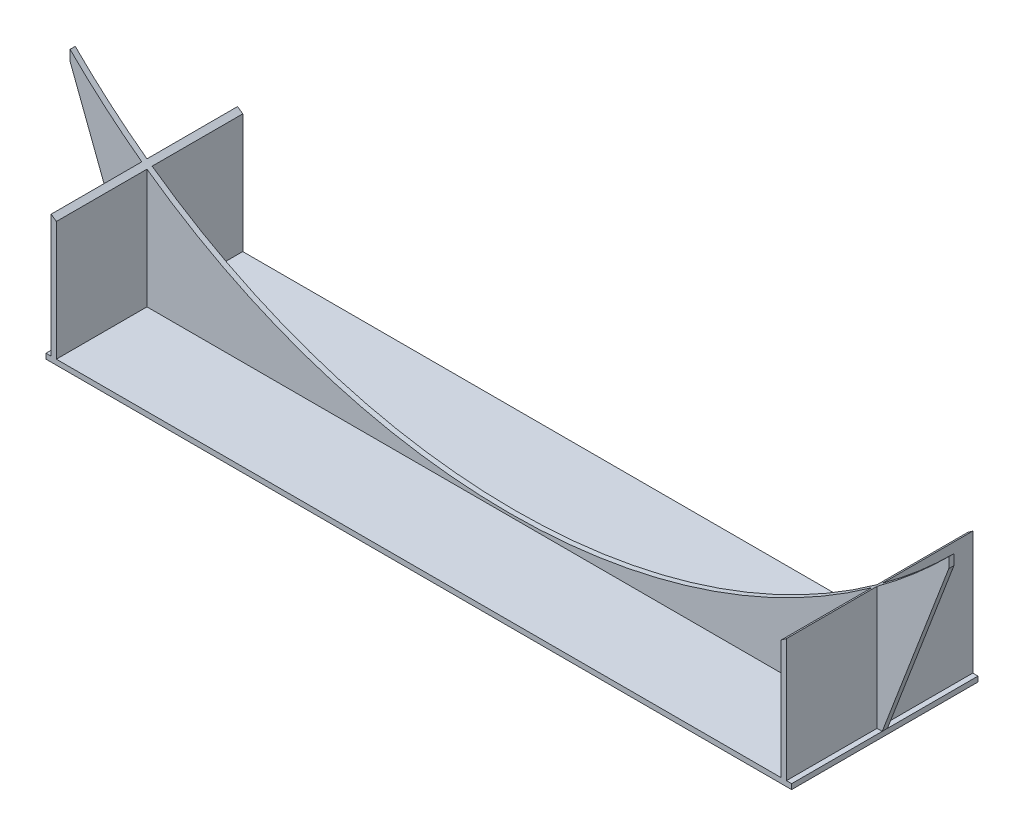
ISO-10303-21;
HEADER;
FILE_DESCRIPTION(('STEP AP214'),'2;1');
FILE_NAME('part.step','',(''),(''),'','','');
FILE_SCHEMA(('AUTOMOTIVE_DESIGN { 1 0 10303 214 1 1 1 1 }'));
ENDSEC;
DATA;
#1=APPLICATION_CONTEXT('core data for automotive mechanical design processes');
#2=APPLICATION_PROTOCOL_DEFINITION('international standard','automotive_design',2000,#1);
#3=PRODUCT_CONTEXT('',#1,'mechanical');
#4=PRODUCT('Part','Part','',(#3));
#5=PRODUCT_RELATED_PRODUCT_CATEGORY('part','',(#4));
#6=PRODUCT_DEFINITION_FORMATION('','',#4);
#7=PRODUCT_DEFINITION_CONTEXT('part definition',#1,'design');
#8=PRODUCT_DEFINITION('design','',#6,#7);
#9=PRODUCT_DEFINITION_SHAPE('','',#8);
#10=(LENGTH_UNIT() NAMED_UNIT(*) SI_UNIT(.MILLI.,.METRE.));
#11=(NAMED_UNIT(*) PLANE_ANGLE_UNIT() SI_UNIT($,.RADIAN.));
#12=(NAMED_UNIT(*) SI_UNIT($,.STERADIAN.) SOLID_ANGLE_UNIT());
#13=UNCERTAINTY_MEASURE_WITH_UNIT(LENGTH_MEASURE(1.E-05),#10,'distance_accuracy_value','');
#14=(GEOMETRIC_REPRESENTATION_CONTEXT(3) GLOBAL_UNCERTAINTY_ASSIGNED_CONTEXT((#13)) GLOBAL_UNIT_ASSIGNED_CONTEXT((#10,
#11,#12)) REPRESENTATION_CONTEXT('',''));
#15=CARTESIAN_POINT('',(0.,0.,0.));
#16=DIRECTION('',(0.,0.,1.));
#17=DIRECTION('',(1.,0.,0.));
#18=AXIS2_PLACEMENT_3D('',#15,#16,#17);
#19=CARTESIAN_POINT('',(0.,1543.05,6.35));
#20=DIRECTION('',(0.,0.,-1.));
#21=DIRECTION('',(-1.,0.,0.));
#22=AXIS2_PLACEMENT_3D('',#19,#20,#21);
#23=PLANE('',#22);
#24=DIRECTION('',(-1.,0.,0.));
#25=VECTOR('',#24,1.);
#26=CARTESIAN_POINT('',(0.,12.6999999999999,6.35));
#27=LINE('',#26,#25);
#28=CARTESIAN_POINT('',(914.4,12.7,6.35));
#29=VERTEX_POINT('',#28);
#30=CARTESIAN_POINT('',(901.7,12.6999999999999,6.35));
#31=VERTEX_POINT('',#30);
#32=EDGE_CURVE('E336',#29,#31,#27,.T.);
#33=ORIENTED_EDGE('',*,*,#32,.F.);
#34=DIRECTION('',(0.356839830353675,0.934165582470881,0.));
#35=VECTOR('',#34,1.);
#36=CARTESIAN_POINT('',(914.4,12.7,6.35));
#37=LINE('',#36,#35);
#38=CARTESIAN_POINT('',(1077.6307345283,440.019265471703,6.35));
#39=VERTEX_POINT('',#38);
#40=EDGE_CURVE('E339',#29,#39,#37,.T.);
#41=ORIENTED_EDGE('',*,*,#40,.T.);
#42=DIRECTION('',(0.,1.,0.));
#43=VECTOR('',#42,1.);
#44=CARTESIAN_POINT('',(1077.6307345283,440.019265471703,6.35));
#45=LINE('',#44,#43);
#46=CARTESIAN_POINT('',(1077.6307345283,465.419265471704,6.35));
#47=VERTEX_POINT('',#46);
#48=EDGE_CURVE('E341',#39,#47,#45,.T.);
#49=ORIENTED_EDGE('',*,*,#48,.T.);
#50=CARTESIAN_POINT('',(0.,1543.05,6.35));
#51=DIRECTION('',(0.,0.,-1.));
#52=DIRECTION('',(-1.,0.,0.));
#53=AXIS2_PLACEMENT_3D('',#50,#51,#52);
#54=CIRCLE('',#53,1524.);
#55=CARTESIAN_POINT('',(901.7,314.427555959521,6.35));
#56=VERTEX_POINT('',#55);
#57=EDGE_CURVE('E345',#47,#56,#54,.T.);
#58=ORIENTED_EDGE('',*,*,#57,.T.);
#59=DIRECTION('',(0.,1.,0.));
#60=VECTOR('',#59,1.);
#61=CARTESIAN_POINT('',(901.700000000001,1543.05,6.35));
#62=LINE('',#61,#60);
#63=EDGE_CURVE('E47',#31,#56,#62,.T.);
#64=ORIENTED_EDGE('',*,*,#63,.F.);
#65=EDGE_LOOP('',(#33,#41,#49,#58,#64));
#66=FACE_BOUND('',#65,.T.);
#67=ADVANCED_FACE('F32',(#66),#23,.F.);
#68=DIRECTION('',(0.,-1.,0.));
#69=VECTOR('',#68,1.);
#70=CARTESIAN_POINT('',(888.999999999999,1543.05,6.35));
#71=LINE('',#70,#69);
#72=CARTESIAN_POINT('',(889.,305.207118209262,6.35));
#73=VERTEX_POINT('',#72);
#74=CARTESIAN_POINT('',(889.,12.6999999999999,6.35));
#75=VERTEX_POINT('',#74);
#76=EDGE_CURVE('E333',#73,#75,#71,.T.);
#77=ORIENTED_EDGE('',*,*,#76,.F.);
#78=CARTESIAN_POINT('',(-889.,305.207118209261,6.35));
#79=VERTEX_POINT('',#78);
#80=EDGE_CURVE('E348',#73,#79,#54,.T.);
#81=ORIENTED_EDGE('',*,*,#80,.T.);
#82=DIRECTION('',(0.,1.,0.));
#83=VECTOR('',#82,1.);
#84=CARTESIAN_POINT('',(-889.,1543.05,6.35));
#85=LINE('',#84,#83);
#86=CARTESIAN_POINT('',(-889.,12.6999999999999,6.35));
#87=VERTEX_POINT('',#86);
#88=EDGE_CURVE('E329',#87,#79,#85,.T.);
#89=ORIENTED_EDGE('',*,*,#88,.F.);
#90=DIRECTION('',(-1.,0.,0.));
#91=VECTOR('',#90,1.);
#92=CARTESIAN_POINT('',(0.,12.6999999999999,6.35));
#93=LINE('',#92,#91);
#94=EDGE_CURVE('E55',#75,#87,#93,.T.);
#95=ORIENTED_EDGE('',*,*,#94,.F.);
#96=EDGE_LOOP('',(#77,#81,#89,#95));
#97=FACE_BOUND('',#96,.T.);
#98=ADVANCED_FACE('F462',(#97),#23,.F.);
#99=DIRECTION('',(0.,-1.,0.));
#100=VECTOR('',#99,1.);
#101=CARTESIAN_POINT('',(-901.700000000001,1543.05,6.35));
#102=LINE('',#101,#100);
#103=CARTESIAN_POINT('',(-901.7,314.427555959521,6.35));
#104=VERTEX_POINT('',#103);
#105=CARTESIAN_POINT('',(-901.7,12.6999999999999,6.35));
#106=VERTEX_POINT('',#105);
#107=EDGE_CURVE('E326',#104,#106,#102,.T.);
#108=ORIENTED_EDGE('',*,*,#107,.F.);
#109=CARTESIAN_POINT('',(-1077.6307345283,465.419265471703,6.35));
#110=VERTEX_POINT('',#109);
#111=EDGE_CURVE('E344',#104,#110,#54,.T.);
#112=ORIENTED_EDGE('',*,*,#111,.T.);
#113=DIRECTION('',(0.,-1.,0.));
#114=VECTOR('',#113,1.);
#115=CARTESIAN_POINT('',(-1077.6307345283,465.419265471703,6.35));
#116=LINE('',#115,#114);
#117=CARTESIAN_POINT('',(-1077.6307345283,440.019265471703,6.35));
#118=VERTEX_POINT('',#117);
#119=EDGE_CURVE('E347',#110,#118,#116,.T.);
#120=ORIENTED_EDGE('',*,*,#119,.T.);
#121=DIRECTION('',(0.356839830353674,-0.934165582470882,0.));
#122=VECTOR('',#121,1.);
#123=CARTESIAN_POINT('',(-914.4,12.7,6.35));
#124=LINE('',#123,#122);
#125=CARTESIAN_POINT('',(-914.4,12.7,6.35));
#126=VERTEX_POINT('',#125);
#127=EDGE_CURVE('E350',#118,#126,#124,.T.);
#128=ORIENTED_EDGE('',*,*,#127,.T.);
#129=DIRECTION('',(-1.,0.,0.));
#130=VECTOR('',#129,1.);
#131=CARTESIAN_POINT('',(0.,12.6999999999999,6.35));
#132=LINE('',#131,#130);
#133=EDGE_CURVE('E323',#106,#126,#132,.T.);
#134=ORIENTED_EDGE('',*,*,#133,.F.);
#135=EDGE_LOOP('',(#108,#112,#120,#128,#134));
#136=FACE_BOUND('',#135,.T.);
#137=ADVANCED_FACE('F455',(#136),#23,.F.);
#138=CARTESIAN_POINT('',(0.,1543.05,-6.35));
#139=DIRECTION('',(0.,0.,-1.));
#140=DIRECTION('',(-1.,0.,0.));
#141=AXIS2_PLACEMENT_3D('',#138,#139,#140);
#142=PLANE('',#141);
#143=DIRECTION('',(0.356839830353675,0.934165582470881,0.));
#144=VECTOR('',#143,1.);
#145=CARTESIAN_POINT('',(914.4,12.7,-6.35));
#146=LINE('',#145,#144);
#147=CARTESIAN_POINT('',(914.4,12.7,-6.34999999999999));
#148=VERTEX_POINT('',#147);
#149=CARTESIAN_POINT('',(1077.6307345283,440.019265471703,-6.35));
#150=VERTEX_POINT('',#149);
#151=EDGE_CURVE('E338',#148,#150,#146,.T.);
#152=ORIENTED_EDGE('',*,*,#151,.F.);
#153=DIRECTION('',(-1.,0.,0.));
#154=VECTOR('',#153,1.);
#155=CARTESIAN_POINT('',(0.,12.6999999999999,-6.35));
#156=LINE('',#155,#154);
#157=CARTESIAN_POINT('',(901.7,12.7,-6.34999999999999));
#158=VERTEX_POINT('',#157);
#159=EDGE_CURVE('E11',#148,#158,#156,.T.);
#160=ORIENTED_EDGE('',*,*,#159,.T.);
#161=DIRECTION('',(0.,1.,0.));
#162=VECTOR('',#161,1.);
#163=CARTESIAN_POINT('',(901.700000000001,1543.05,-6.35));
#164=LINE('',#163,#162);
#165=CARTESIAN_POINT('',(901.7,314.427555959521,-6.34999999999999));
#166=VERTEX_POINT('',#165);
#167=EDGE_CURVE('E40',#158,#166,#164,.T.);
#168=ORIENTED_EDGE('',*,*,#167,.T.);
#169=CARTESIAN_POINT('',(0.,1543.05,-6.35));
#170=DIRECTION('',(0.,0.,-1.));
#171=DIRECTION('',(-1.,0.,0.));
#172=AXIS2_PLACEMENT_3D('',#169,#170,#171);
#173=CIRCLE('',#172,1524.);
#174=CARTESIAN_POINT('',(1077.6307345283,465.419265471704,-6.35));
#175=VERTEX_POINT('',#174);
#176=EDGE_CURVE('E357',#175,#166,#173,.T.);
#177=ORIENTED_EDGE('',*,*,#176,.F.);
#178=DIRECTION('',(0.,1.,0.));
#179=VECTOR('',#178,1.);
#180=CARTESIAN_POINT('',(1077.6307345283,440.019265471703,-6.35));
#181=LINE('',#180,#179);
#182=EDGE_CURVE('E354',#150,#175,#181,.T.);
#183=ORIENTED_EDGE('',*,*,#182,.F.);
#184=EDGE_LOOP('',(#152,#160,#168,#177,#183));
#185=FACE_BOUND('',#184,.T.);
#186=ADVANCED_FACE('F400',(#185),#142,.T.);
#187=CARTESIAN_POINT('',(889.,305.207118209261,-6.34999999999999));
#188=VERTEX_POINT('',#187);
#189=CARTESIAN_POINT('',(-889.,305.207118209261,-6.34999999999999));
#190=VERTEX_POINT('',#189);
#191=EDGE_CURVE('E361',#188,#190,#173,.T.);
#192=ORIENTED_EDGE('',*,*,#191,.F.);
#193=DIRECTION('',(0.,-1.,0.));
#194=VECTOR('',#193,1.);
#195=CARTESIAN_POINT('',(888.999999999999,1543.05,-6.35));
#196=LINE('',#195,#194);
#197=CARTESIAN_POINT('',(889.,12.7,-6.34999999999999));
#198=VERTEX_POINT('',#197);
#199=EDGE_CURVE('E394',#188,#198,#196,.T.);
#200=ORIENTED_EDGE('',*,*,#199,.T.);
#201=DIRECTION('',(-1.,0.,0.));
#202=VECTOR('',#201,1.);
#203=CARTESIAN_POINT('',(0.,12.6999999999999,-6.35));
#204=LINE('',#203,#202);
#205=CARTESIAN_POINT('',(-889.,12.7,-6.34999999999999));
#206=VERTEX_POINT('',#205);
#207=EDGE_CURVE('E391',#198,#206,#204,.T.);
#208=ORIENTED_EDGE('',*,*,#207,.T.);
#209=DIRECTION('',(0.,1.,0.));
#210=VECTOR('',#209,1.);
#211=CARTESIAN_POINT('',(-889.,1543.05,-6.35));
#212=LINE('',#211,#210);
#213=EDGE_CURVE('E388',#206,#190,#212,.T.);
#214=ORIENTED_EDGE('',*,*,#213,.T.);
#215=EDGE_LOOP('',(#192,#200,#208,#214));
#216=FACE_BOUND('',#215,.T.);
#217=ADVANCED_FACE('F432',(#216),#142,.T.);
#218=CARTESIAN_POINT('',(-901.7,314.427555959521,-6.34999999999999));
#219=VERTEX_POINT('',#218);
#220=CARTESIAN_POINT('',(-1077.6307345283,465.419265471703,-6.35));
#221=VERTEX_POINT('',#220);
#222=EDGE_CURVE('E356',#219,#221,#173,.T.);
#223=ORIENTED_EDGE('',*,*,#222,.F.);
#224=DIRECTION('',(0.,-1.,0.));
#225=VECTOR('',#224,1.);
#226=CARTESIAN_POINT('',(-901.700000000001,1543.05,-6.35));
#227=LINE('',#226,#225);
#228=CARTESIAN_POINT('',(-901.7,12.7,-6.34999999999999));
#229=VERTEX_POINT('',#228);
#230=EDGE_CURVE('E385',#219,#229,#227,.T.);
#231=ORIENTED_EDGE('',*,*,#230,.T.);
#232=DIRECTION('',(-1.,0.,0.));
#233=VECTOR('',#232,1.);
#234=CARTESIAN_POINT('',(0.,12.6999999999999,-6.35));
#235=LINE('',#234,#233);
#236=CARTESIAN_POINT('',(-914.4,12.7,-6.34999999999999));
#237=VERTEX_POINT('',#236);
#238=EDGE_CURVE('E382',#229,#237,#235,.T.);
#239=ORIENTED_EDGE('',*,*,#238,.T.);
#240=DIRECTION('',(0.356839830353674,-0.934165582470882,0.));
#241=VECTOR('',#240,1.);
#242=CARTESIAN_POINT('',(-914.4,12.7,-6.35));
#243=LINE('',#242,#241);
#244=CARTESIAN_POINT('',(-1077.6307345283,440.019265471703,-6.35));
#245=VERTEX_POINT('',#244);
#246=EDGE_CURVE('E342',#245,#237,#243,.T.);
#247=ORIENTED_EDGE('',*,*,#246,.F.);
#248=DIRECTION('',(0.,-1.,0.));
#249=VECTOR('',#248,1.);
#250=CARTESIAN_POINT('',(-1077.6307345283,465.419265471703,-6.35));
#251=LINE('',#250,#249);
#252=EDGE_CURVE('E360',#221,#245,#251,.T.);
#253=ORIENTED_EDGE('',*,*,#252,.F.);
#254=EDGE_LOOP('',(#223,#231,#239,#247,#253));
#255=FACE_BOUND('',#254,.T.);
#256=ADVANCED_FACE('F443',(#255),#142,.T.);
#257=CARTESIAN_POINT('',(-914.4,0.,6.35));
#258=DIRECTION('',(1.,0.,0.));
#259=DIRECTION('',(0.,1.,0.));
#260=AXIS2_PLACEMENT_3D('',#257,#258,#259);
#261=PLANE('',#260);
#262=DIRECTION('',(0.,0.,-1.));
#263=VECTOR('',#262,1.);
#264=CARTESIAN_POINT('',(-914.4,12.7,6.35));
#265=LINE('',#264,#263);
#266=EDGE_CURVE('E352',#126,#237,#265,.T.);
#267=ORIENTED_EDGE('',*,*,#266,.T.);
#268=DIRECTION('',(0.,0.,-1.));
#269=VECTOR('',#268,1.);
#270=CARTESIAN_POINT('',(-914.4,12.7,228.6));
#271=LINE('',#270,#269);
#272=CARTESIAN_POINT('',(-914.4,12.7,-228.6));
#273=VERTEX_POINT('',#272);
#274=EDGE_CURVE('E256',#237,#273,#271,.T.);
#275=ORIENTED_EDGE('',*,*,#274,.T.);
#276=DIRECTION('',(0.,-1.,0.));
#277=VECTOR('',#276,1.);
#278=CARTESIAN_POINT('',(-914.4,0.,-228.6));
#279=LINE('',#278,#277);
#280=CARTESIAN_POINT('',(-914.4,0.,-228.6));
#281=VERTEX_POINT('',#280);
#282=EDGE_CURVE('E232',#273,#281,#279,.T.);
#283=ORIENTED_EDGE('',*,*,#282,.T.);
#284=DIRECTION('',(0.,0.,-1.));
#285=VECTOR('',#284,1.);
#286=CARTESIAN_POINT('',(-914.4,0.,6.35));
#287=LINE('',#286,#285);
#288=CARTESIAN_POINT('',(-914.4,0.,228.6));
#289=VERTEX_POINT('',#288);
#290=EDGE_CURVE('E215',#289,#281,#287,.T.);
#291=ORIENTED_EDGE('',*,*,#290,.F.);
#292=DIRECTION('',(0.,-1.,0.));
#293=VECTOR('',#292,1.);
#294=CARTESIAN_POINT('',(-914.4,0.,228.6));
#295=LINE('',#294,#293);
#296=CARTESIAN_POINT('',(-914.4,12.7,228.6));
#297=VERTEX_POINT('',#296);
#298=EDGE_CURVE('E231',#297,#289,#295,.T.);
#299=ORIENTED_EDGE('',*,*,#298,.F.);
#300=EDGE_CURVE('E286',#297,#126,#271,.T.);
#301=ORIENTED_EDGE('',*,*,#300,.T.);
#302=EDGE_LOOP('',(#267,#275,#283,#291,#299,#301));
#303=FACE_BOUND('',#302,.T.);
#304=ADVANCED_FACE('F34',(#303),#261,.F.);
#305=CARTESIAN_POINT('',(-914.4,0.,6.35));
#306=DIRECTION('',(0.,1.,0.));
#307=DIRECTION('',(0.,0.,1.));
#308=AXIS2_PLACEMENT_3D('',#305,#306,#307);
#309=PLANE('',#308);
#310=ORIENTED_EDGE('',*,*,#290,.T.);
#311=DIRECTION('',(1.,0.,0.));
#312=VECTOR('',#311,1.);
#313=CARTESIAN_POINT('',(914.4,0.,-228.6));
#314=LINE('',#313,#312);
#315=CARTESIAN_POINT('',(914.4,0.,-228.6));
#316=VERTEX_POINT('',#315);
#317=EDGE_CURVE('E211',#281,#316,#314,.T.);
#318=ORIENTED_EDGE('',*,*,#317,.T.);
#319=DIRECTION('',(0.,0.,-1.));
#320=VECTOR('',#319,1.);
#321=CARTESIAN_POINT('',(914.4,0.,6.35));
#322=LINE('',#321,#320);
#323=CARTESIAN_POINT('',(914.4,0.,228.6));
#324=VERTEX_POINT('',#323);
#325=EDGE_CURVE('E205',#324,#316,#322,.T.);
#326=ORIENTED_EDGE('',*,*,#325,.F.);
#327=DIRECTION('',(1.,0.,0.));
#328=VECTOR('',#327,1.);
#329=CARTESIAN_POINT('',(914.4,0.,228.6));
#330=LINE('',#329,#328);
#331=EDGE_CURVE('E209',#289,#324,#330,.T.);
#332=ORIENTED_EDGE('',*,*,#331,.F.);
#333=EDGE_LOOP('',(#310,#318,#326,#332));
#334=FACE_BOUND('',#333,.T.);
#335=ADVANCED_FACE('F207',(#334),#309,.F.);
#336=CARTESIAN_POINT('',(914.4,0.,6.35));
#337=DIRECTION('',(-1.,0.,0.));
#338=DIRECTION('',(0.,-1.,0.));
#339=AXIS2_PLACEMENT_3D('',#336,#337,#338);
#340=PLANE('',#339);
#341=ORIENTED_EDGE('',*,*,#325,.T.);
#342=DIRECTION('',(0.,1.,0.));
#343=VECTOR('',#342,1.);
#344=CARTESIAN_POINT('',(914.4,12.7,-228.6));
#345=LINE('',#344,#343);
#346=CARTESIAN_POINT('',(914.4,12.7,-228.6));
#347=VERTEX_POINT('',#346);
#348=EDGE_CURVE('E258',#316,#347,#345,.T.);
#349=ORIENTED_EDGE('',*,*,#348,.T.);
#350=DIRECTION('',(0.,0.,-1.));
#351=VECTOR('',#350,1.);
#352=CARTESIAN_POINT('',(914.4,12.7,228.6));
#353=LINE('',#352,#351);
#354=EDGE_CURVE('E321',#148,#347,#353,.T.);
#355=ORIENTED_EDGE('',*,*,#354,.F.);
#356=DIRECTION('',(0.,0.,-1.));
#357=VECTOR('',#356,1.);
#358=CARTESIAN_POINT('',(914.4,12.7,6.35));
#359=LINE('',#358,#357);
#360=EDGE_CURVE('E216',#29,#148,#359,.T.);
#361=ORIENTED_EDGE('',*,*,#360,.F.);
#362=CARTESIAN_POINT('',(914.4,12.7,228.6));
#363=VERTEX_POINT('',#362);
#364=EDGE_CURVE('E223',#363,#29,#353,.T.);
#365=ORIENTED_EDGE('',*,*,#364,.F.);
#366=DIRECTION('',(0.,1.,0.));
#367=VECTOR('',#366,1.);
#368=CARTESIAN_POINT('',(914.4,12.7,228.6));
#369=LINE('',#368,#367);
#370=EDGE_CURVE('E219',#324,#363,#369,.T.);
#371=ORIENTED_EDGE('',*,*,#370,.F.);
#372=EDGE_LOOP('',(#341,#349,#355,#361,#365,#371));
#373=FACE_BOUND('',#372,.T.);
#374=ADVANCED_FACE('F220',(#373),#340,.F.);
#375=CARTESIAN_POINT('',(914.4,12.7,6.35));
#376=DIRECTION('',(-0.934165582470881,0.356839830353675,0.));
#377=DIRECTION('',(-0.356839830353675,-0.934165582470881,0.));
#378=AXIS2_PLACEMENT_3D('',#375,#376,#377);
#379=PLANE('',#378);
#380=ORIENTED_EDGE('',*,*,#151,.T.);
#381=DIRECTION('',(0.,0.,-1.));
#382=VECTOR('',#381,1.);
#383=CARTESIAN_POINT('',(1077.6307345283,440.019265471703,6.35));
#384=LINE('',#383,#382);
#385=EDGE_CURVE('E376',#39,#150,#384,.T.);
#386=ORIENTED_EDGE('',*,*,#385,.F.);
#387=ORIENTED_EDGE('',*,*,#40,.F.);
#388=ORIENTED_EDGE('',*,*,#360,.T.);
#389=EDGE_LOOP('',(#380,#386,#387,#388));
#390=FACE_BOUND('',#389,.T.);
#391=ADVANCED_FACE('F414',(#390),#379,.F.);
#392=CARTESIAN_POINT('',(1077.6307345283,440.019265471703,6.35));
#393=DIRECTION('',(-1.,0.,0.));
#394=DIRECTION('',(0.,-1.,0.));
#395=AXIS2_PLACEMENT_3D('',#392,#393,#394);
#396=PLANE('',#395);
#397=ORIENTED_EDGE('',*,*,#182,.T.);
#398=DIRECTION('',(0.,0.,-1.));
#399=VECTOR('',#398,1.);
#400=CARTESIAN_POINT('',(1077.6307345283,465.419265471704,6.35));
#401=LINE('',#400,#399);
#402=EDGE_CURVE('E373',#47,#175,#401,.T.);
#403=ORIENTED_EDGE('',*,*,#402,.F.);
#404=ORIENTED_EDGE('',*,*,#48,.F.);
#405=ORIENTED_EDGE('',*,*,#385,.T.);
#406=EDGE_LOOP('',(#397,#403,#404,#405));
#407=FACE_BOUND('',#406,.T.);
#408=ADVANCED_FACE('F411',(#407),#396,.F.);
#409=CARTESIAN_POINT('',(0.,1543.05,6.35));
#410=DIRECTION('',(0.,0.,-1.));
#411=DIRECTION('',(-1.,0.,0.));
#412=AXIS2_PLACEMENT_3D('',#409,#410,#411);
#413=CYLINDRICAL_SURFACE('',#412,1524.);
#414=DIRECTION('',(0.,0.,-1.));
#415=VECTOR('',#414,1.);
#416=CARTESIAN_POINT('',(-901.7,314.427555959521,228.6));
#417=LINE('',#416,#415);
#418=CARTESIAN_POINT('',(-901.7,314.427555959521,-228.6));
#419=VERTEX_POINT('',#418);
#420=EDGE_CURVE('E293',#219,#419,#417,.T.);
#421=ORIENTED_EDGE('',*,*,#420,.F.);
#422=ORIENTED_EDGE('',*,*,#222,.T.);
#423=DIRECTION('',(0.,0.,-1.));
#424=VECTOR('',#423,1.);
#425=CARTESIAN_POINT('',(-1077.6307345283,465.419265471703,6.35));
#426=LINE('',#425,#424);
#427=EDGE_CURVE('E370',#110,#221,#426,.T.);
#428=ORIENTED_EDGE('',*,*,#427,.F.);
#429=ORIENTED_EDGE('',*,*,#111,.F.);
#430=CARTESIAN_POINT('',(-901.7,314.427555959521,228.6));
#431=VERTEX_POINT('',#430);
#432=EDGE_CURVE('E294',#431,#104,#417,.T.);
#433=ORIENTED_EDGE('',*,*,#432,.F.);
#434=CARTESIAN_POINT('',(-1.11022302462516E-13,1543.05,228.6));
#435=DIRECTION('',(0.,0.,-1.));
#436=DIRECTION('',(1.,0.,0.));
#437=AXIS2_PLACEMENT_3D('',#434,#435,#436);
#438=CIRCLE('',#437,1524.);
#439=CARTESIAN_POINT('',(-889.,305.207118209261,228.6));
#440=VERTEX_POINT('',#439);
#441=EDGE_CURVE('E249',#440,#431,#438,.T.);
#442=ORIENTED_EDGE('',*,*,#441,.F.);
#443=DIRECTION('',(0.,0.,-1.));
#444=VECTOR('',#443,1.);
#445=CARTESIAN_POINT('',(-889.,305.207118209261,228.6));
#446=LINE('',#445,#444);
#447=EDGE_CURVE('E298',#440,#79,#446,.T.);
#448=ORIENTED_EDGE('',*,*,#447,.T.);
#449=ORIENTED_EDGE('',*,*,#80,.F.);
#450=DIRECTION('',(0.,0.,-1.));
#451=VECTOR('',#450,1.);
#452=CARTESIAN_POINT('',(889.,305.207118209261,228.6));
#453=LINE('',#452,#451);
#454=CARTESIAN_POINT('',(889.,305.207118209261,228.6));
#455=VERTEX_POINT('',#454);
#456=EDGE_CURVE('E310',#455,#73,#453,.T.);
#457=ORIENTED_EDGE('',*,*,#456,.F.);
#458=CARTESIAN_POINT('',(-1.11022302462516E-13,1543.05,228.6));
#459=DIRECTION('',(0.,0.,-1.));
#460=DIRECTION('',(1.,0.,0.));
#461=AXIS2_PLACEMENT_3D('',#458,#459,#460);
#462=CIRCLE('',#461,1524.);
#463=CARTESIAN_POINT('',(901.7,314.427555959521,228.6));
#464=VERTEX_POINT('',#463);
#465=EDGE_CURVE('E241',#464,#455,#462,.T.);
#466=ORIENTED_EDGE('',*,*,#465,.F.);
#467=DIRECTION('',(0.,0.,-1.));
#468=VECTOR('',#467,1.);
#469=CARTESIAN_POINT('',(901.7,314.427555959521,228.6));
#470=LINE('',#469,#468);
#471=EDGE_CURVE('E314',#464,#56,#470,.T.);
#472=ORIENTED_EDGE('',*,*,#471,.T.);
#473=ORIENTED_EDGE('',*,*,#57,.F.);
#474=ORIENTED_EDGE('',*,*,#402,.T.);
#475=ORIENTED_EDGE('',*,*,#176,.T.);
#476=CARTESIAN_POINT('',(901.7,314.427555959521,-228.6));
#477=VERTEX_POINT('',#476);
#478=EDGE_CURVE('E313',#166,#477,#470,.T.);
#479=ORIENTED_EDGE('',*,*,#478,.T.);
#480=CARTESIAN_POINT('',(-1.11022302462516E-13,1543.05,-228.6));
#481=DIRECTION('',(0.,0.,-1.));
#482=DIRECTION('',(1.,0.,0.));
#483=AXIS2_PLACEMENT_3D('',#480,#481,#482);
#484=CIRCLE('',#483,1524.);
#485=CARTESIAN_POINT('',(889.,305.207118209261,-228.6));
#486=VERTEX_POINT('',#485);
#487=EDGE_CURVE('E266',#477,#486,#484,.T.);
#488=ORIENTED_EDGE('',*,*,#487,.T.);
#489=EDGE_CURVE('E309',#188,#486,#453,.T.);
#490=ORIENTED_EDGE('',*,*,#489,.F.);
#491=ORIENTED_EDGE('',*,*,#191,.T.);
#492=CARTESIAN_POINT('',(-889.,305.207118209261,-228.6));
#493=VERTEX_POINT('',#492);
#494=EDGE_CURVE('E297',#190,#493,#446,.T.);
#495=ORIENTED_EDGE('',*,*,#494,.T.);
#496=CARTESIAN_POINT('',(-1.11022302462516E-13,1543.05,-228.6));
#497=DIRECTION('',(0.,0.,-1.));
#498=DIRECTION('',(1.,0.,0.));
#499=AXIS2_PLACEMENT_3D('',#496,#497,#498);
#500=CIRCLE('',#499,1524.);
#501=EDGE_CURVE('E278',#493,#419,#500,.T.);
#502=ORIENTED_EDGE('',*,*,#501,.T.);
#503=EDGE_LOOP('',(#421,#422,#428,#429,#433,#442,#448,#449,#457,#466,#472,#473,#474,#475,#479,
#488,#490,#491,#495,#502));
#504=FACE_BOUND('',#503,.T.);
#505=ADVANCED_FACE('F406',(#504),#413,.F.);
#506=CARTESIAN_POINT('',(-1077.6307345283,465.419265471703,6.35));
#507=DIRECTION('',(1.,0.,0.));
#508=DIRECTION('',(0.,1.,0.));
#509=AXIS2_PLACEMENT_3D('',#506,#507,#508);
#510=PLANE('',#509);
#511=ORIENTED_EDGE('',*,*,#252,.T.);
#512=DIRECTION('',(0.,0.,-1.));
#513=VECTOR('',#512,1.);
#514=CARTESIAN_POINT('',(-1077.6307345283,440.019265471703,6.35));
#515=LINE('',#514,#513);
#516=EDGE_CURVE('E367',#118,#245,#515,.T.);
#517=ORIENTED_EDGE('',*,*,#516,.F.);
#518=ORIENTED_EDGE('',*,*,#119,.F.);
#519=ORIENTED_EDGE('',*,*,#427,.T.);
#520=EDGE_LOOP('',(#511,#517,#518,#519));
#521=FACE_BOUND('',#520,.T.);
#522=ADVANCED_FACE('F440',(#521),#510,.F.);
#523=CARTESIAN_POINT('',(-914.4,12.7,6.35));
#524=DIRECTION('',(0.934165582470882,0.356839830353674,0.));
#525=DIRECTION('',(-0.356839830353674,0.934165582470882,0.));
#526=AXIS2_PLACEMENT_3D('',#523,#524,#525);
#527=PLANE('',#526);
#528=ORIENTED_EDGE('',*,*,#246,.T.);
#529=ORIENTED_EDGE('',*,*,#266,.F.);
#530=ORIENTED_EDGE('',*,*,#127,.F.);
#531=ORIENTED_EDGE('',*,*,#516,.T.);
#532=EDGE_LOOP('',(#528,#529,#530,#531));
#533=FACE_BOUND('',#532,.T.);
#534=ADVANCED_FACE('F446',(#533),#527,.F.);
#535=CARTESIAN_POINT('',(-1.11022302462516E-13,1543.05,-228.6));
#536=DIRECTION('',(0.,0.,1.));
#537=DIRECTION('',(1.,0.,0.));
#538=AXIS2_PLACEMENT_3D('',#535,#536,#537);
#539=PLANE('',#538);
#540=ORIENTED_EDGE('',*,*,#317,.F.);
#541=ORIENTED_EDGE('',*,*,#282,.F.);
#542=DIRECTION('',(-1.,0.,0.));
#543=VECTOR('',#542,1.);
#544=CARTESIAN_POINT('',(-914.4,12.7,-228.6));
#545=LINE('',#544,#543);
#546=CARTESIAN_POINT('',(-901.7,12.7,-228.6));
#547=VERTEX_POINT('',#546);
#548=EDGE_CURVE('E235',#547,#273,#545,.T.);
#549=ORIENTED_EDGE('',*,*,#548,.F.);
#550=DIRECTION('',(0.,-1.,0.));
#551=VECTOR('',#550,1.);
#552=CARTESIAN_POINT('',(-901.7,12.7,-228.6));
#553=LINE('',#552,#551);
#554=EDGE_CURVE('E281',#419,#547,#553,.T.);
#555=ORIENTED_EDGE('',*,*,#554,.F.);
#556=ORIENTED_EDGE('',*,*,#501,.F.);
#557=DIRECTION('',(0.,1.,0.));
#558=VECTOR('',#557,1.);
#559=CARTESIAN_POINT('',(-889.,305.207118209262,-228.6));
#560=LINE('',#559,#558);
#561=CARTESIAN_POINT('',(-889.,12.7,-228.6));
#562=VERTEX_POINT('',#561);
#563=EDGE_CURVE('E275',#562,#493,#560,.T.);
#564=ORIENTED_EDGE('',*,*,#563,.F.);
#565=DIRECTION('',(-1.,0.,0.));
#566=VECTOR('',#565,1.);
#567=CARTESIAN_POINT('',(-889.,12.7,-228.6));
#568=LINE('',#567,#566);
#569=CARTESIAN_POINT('',(889.,12.7,-228.6));
#570=VERTEX_POINT('',#569);
#571=EDGE_CURVE('E272',#570,#562,#568,.T.);
#572=ORIENTED_EDGE('',*,*,#571,.F.);
#573=DIRECTION('',(0.,-1.,0.));
#574=VECTOR('',#573,1.);
#575=CARTESIAN_POINT('',(889.,12.7,-228.6));
#576=LINE('',#575,#574);
#577=EDGE_CURVE('E269',#486,#570,#576,.T.);
#578=ORIENTED_EDGE('',*,*,#577,.F.);
#579=ORIENTED_EDGE('',*,*,#487,.F.);
#580=DIRECTION('',(0.,1.,0.));
#581=VECTOR('',#580,1.);
#582=CARTESIAN_POINT('',(901.7,314.427555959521,-228.6));
#583=LINE('',#582,#581);
#584=CARTESIAN_POINT('',(901.7,12.7,-228.6));
#585=VERTEX_POINT('',#584);
#586=EDGE_CURVE('E263',#585,#477,#583,.T.);
#587=ORIENTED_EDGE('',*,*,#586,.F.);
#588=DIRECTION('',(-1.,0.,0.));
#589=VECTOR('',#588,1.);
#590=CARTESIAN_POINT('',(901.7,12.7,-228.6));
#591=LINE('',#590,#589);
#592=EDGE_CURVE('E260',#347,#585,#591,.T.);
#593=ORIENTED_EDGE('',*,*,#592,.F.);
#594=ORIENTED_EDGE('',*,*,#348,.F.);
#595=EDGE_LOOP('',(#540,#541,#549,#555,#556,#564,#572,#578,#579,#587,#593,#594));
#596=FACE_BOUND('',#595,.T.);
#597=ADVANCED_FACE('F425',(#596),#539,.F.);
#598=CARTESIAN_POINT('',(-914.4,12.7,228.6));
#599=DIRECTION('',(0.,-1.,0.));
#600=DIRECTION('',(0.,0.,-1.));
#601=AXIS2_PLACEMENT_3D('',#598,#599,#600);
#602=PLANE('',#601);
#603=ORIENTED_EDGE('',*,*,#238,.F.);
#604=DIRECTION('',(0.,0.,-1.));
#605=VECTOR('',#604,1.);
#606=CARTESIAN_POINT('',(-901.7,12.7,228.6));
#607=LINE('',#606,#605);
#608=EDGE_CURVE('E289',#229,#547,#607,.T.);
#609=ORIENTED_EDGE('',*,*,#608,.T.);
#610=ORIENTED_EDGE('',*,*,#548,.T.);
#611=ORIENTED_EDGE('',*,*,#274,.F.);
#612=EDGE_LOOP('',(#603,#609,#610,#611));
#613=FACE_BOUND('',#612,.T.);
#614=ADVANCED_FACE('F526',(#613),#602,.F.);
#615=CARTESIAN_POINT('',(-901.7,12.7,228.6));
#616=DIRECTION('',(1.,0.,0.));
#617=DIRECTION('',(0.,1.,0.));
#618=AXIS2_PLACEMENT_3D('',#615,#616,#617);
#619=PLANE('',#618);
#620=ORIENTED_EDGE('',*,*,#230,.F.);
#621=ORIENTED_EDGE('',*,*,#420,.T.);
#622=ORIENTED_EDGE('',*,*,#554,.T.);
#623=ORIENTED_EDGE('',*,*,#608,.F.);
#624=EDGE_LOOP('',(#620,#621,#622,#623));
#625=FACE_BOUND('',#624,.T.);
#626=ADVANCED_FACE('F530',(#625),#619,.F.);
#627=CARTESIAN_POINT('',(-889.,305.207118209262,228.6));
#628=DIRECTION('',(-1.,0.,0.));
#629=DIRECTION('',(0.,0.,1.));
#630=AXIS2_PLACEMENT_3D('',#627,#628,#629);
#631=PLANE('',#630);
#632=ORIENTED_EDGE('',*,*,#213,.F.);
#633=DIRECTION('',(0.,0.,-1.));
#634=VECTOR('',#633,1.);
#635=CARTESIAN_POINT('',(-889.,12.7,228.6));
#636=LINE('',#635,#634);
#637=EDGE_CURVE('E301',#206,#562,#636,.T.);
#638=ORIENTED_EDGE('',*,*,#637,.T.);
#639=ORIENTED_EDGE('',*,*,#563,.T.);
#640=ORIENTED_EDGE('',*,*,#494,.F.);
#641=EDGE_LOOP('',(#632,#638,#639,#640));
#642=FACE_BOUND('',#641,.T.);
#643=ADVANCED_FACE('F537',(#642),#631,.F.);
#644=CARTESIAN_POINT('',(-889.,12.7,228.6));
#645=DIRECTION('',(0.,-1.,0.));
#646=DIRECTION('',(0.,0.,-1.));
#647=AXIS2_PLACEMENT_3D('',#644,#645,#646);
#648=PLANE('',#647);
#649=ORIENTED_EDGE('',*,*,#207,.F.);
#650=DIRECTION('',(0.,0.,-1.));
#651=VECTOR('',#650,1.);
#652=CARTESIAN_POINT('',(889.,12.7,228.6));
#653=LINE('',#652,#651);
#654=EDGE_CURVE('E305',#198,#570,#653,.T.);
#655=ORIENTED_EDGE('',*,*,#654,.T.);
#656=ORIENTED_EDGE('',*,*,#571,.T.);
#657=ORIENTED_EDGE('',*,*,#637,.F.);
#658=EDGE_LOOP('',(#649,#655,#656,#657));
#659=FACE_BOUND('',#658,.T.);
#660=ADVANCED_FACE('F541',(#659),#648,.F.);
#661=CARTESIAN_POINT('',(889.,12.7,228.6));
#662=DIRECTION('',(1.,0.,0.));
#663=DIRECTION('',(0.,1.,0.));
#664=AXIS2_PLACEMENT_3D('',#661,#662,#663);
#665=PLANE('',#664);
#666=ORIENTED_EDGE('',*,*,#199,.F.);
#667=ORIENTED_EDGE('',*,*,#489,.T.);
#668=ORIENTED_EDGE('',*,*,#577,.T.);
#669=ORIENTED_EDGE('',*,*,#654,.F.);
#670=EDGE_LOOP('',(#666,#667,#668,#669));
#671=FACE_BOUND('',#670,.T.);
#672=ADVANCED_FACE('F545',(#671),#665,.F.);
#673=CARTESIAN_POINT('',(901.7,314.427555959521,228.6));
#674=DIRECTION('',(-1.,0.,0.));
#675=DIRECTION('',(0.,-1.,0.));
#676=AXIS2_PLACEMENT_3D('',#673,#674,#675);
#677=PLANE('',#676);
#678=ORIENTED_EDGE('',*,*,#167,.F.);
#679=DIRECTION('',(0.,0.,-1.));
#680=VECTOR('',#679,1.);
#681=CARTESIAN_POINT('',(901.7,12.7,228.6));
#682=LINE('',#681,#680);
#683=EDGE_CURVE('E317',#158,#585,#682,.T.);
#684=ORIENTED_EDGE('',*,*,#683,.T.);
#685=ORIENTED_EDGE('',*,*,#586,.T.);
#686=ORIENTED_EDGE('',*,*,#478,.F.);
#687=EDGE_LOOP('',(#678,#684,#685,#686));
#688=FACE_BOUND('',#687,.T.);
#689=ADVANCED_FACE('F421',(#688),#677,.F.);
#690=CARTESIAN_POINT('',(901.7,12.7,228.6));
#691=DIRECTION('',(0.,-1.,0.));
#692=DIRECTION('',(0.,0.,-1.));
#693=AXIS2_PLACEMENT_3D('',#690,#691,#692);
#694=PLANE('',#693);
#695=ORIENTED_EDGE('',*,*,#159,.F.);
#696=ORIENTED_EDGE('',*,*,#354,.T.);
#697=ORIENTED_EDGE('',*,*,#592,.T.);
#698=ORIENTED_EDGE('',*,*,#683,.F.);
#699=EDGE_LOOP('',(#695,#696,#697,#698));
#700=FACE_BOUND('',#699,.T.);
#701=ADVANCED_FACE('F419',(#700),#694,.F.);
#702=ORIENTED_EDGE('',*,*,#364,.T.);
#703=ORIENTED_EDGE('',*,*,#32,.T.);
#704=CARTESIAN_POINT('',(901.7,12.7,228.6));
#705=VERTEX_POINT('',#704);
#706=EDGE_CURVE('E318',#705,#31,#682,.T.);
#707=ORIENTED_EDGE('',*,*,#706,.F.);
#708=DIRECTION('',(-1.,0.,0.));
#709=VECTOR('',#708,1.);
#710=CARTESIAN_POINT('',(901.7,12.7,228.6));
#711=LINE('',#710,#709);
#712=EDGE_CURVE('E226',#363,#705,#711,.T.);
#713=ORIENTED_EDGE('',*,*,#712,.F.);
#714=EDGE_LOOP('',(#702,#703,#707,#713));
#715=FACE_BOUND('',#714,.T.);
#716=ADVANCED_FACE('F483',(#715),#694,.F.);
#717=ORIENTED_EDGE('',*,*,#706,.T.);
#718=ORIENTED_EDGE('',*,*,#63,.T.);
#719=ORIENTED_EDGE('',*,*,#471,.F.);
#720=DIRECTION('',(0.,1.,0.));
#721=VECTOR('',#720,1.);
#722=CARTESIAN_POINT('',(901.7,314.427555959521,228.6));
#723=LINE('',#722,#721);
#724=EDGE_CURVE('E239',#705,#464,#723,.T.);
#725=ORIENTED_EDGE('',*,*,#724,.F.);
#726=EDGE_LOOP('',(#717,#718,#719,#725));
#727=FACE_BOUND('',#726,.T.);
#728=ADVANCED_FACE('F481',(#727),#677,.F.);
#729=ORIENTED_EDGE('',*,*,#456,.T.);
#730=ORIENTED_EDGE('',*,*,#76,.T.);
#731=CARTESIAN_POINT('',(889.,12.7,228.6));
#732=VERTEX_POINT('',#731);
#733=EDGE_CURVE('E306',#732,#75,#653,.T.);
#734=ORIENTED_EDGE('',*,*,#733,.F.);
#735=DIRECTION('',(0.,-1.,0.));
#736=VECTOR('',#735,1.);
#737=CARTESIAN_POINT('',(889.,12.7,228.6));
#738=LINE('',#737,#736);
#739=EDGE_CURVE('E243',#455,#732,#738,.T.);
#740=ORIENTED_EDGE('',*,*,#739,.F.);
#741=EDGE_LOOP('',(#729,#730,#734,#740));
#742=FACE_BOUND('',#741,.T.);
#743=ADVANCED_FACE('F475',(#742),#665,.F.);
#744=ORIENTED_EDGE('',*,*,#733,.T.);
#745=ORIENTED_EDGE('',*,*,#94,.T.);
#746=CARTESIAN_POINT('',(-889.,12.7,228.6));
#747=VERTEX_POINT('',#746);
#748=EDGE_CURVE('E302',#747,#87,#636,.T.);
#749=ORIENTED_EDGE('',*,*,#748,.F.);
#750=DIRECTION('',(-1.,0.,0.));
#751=VECTOR('',#750,1.);
#752=CARTESIAN_POINT('',(-889.,12.7,228.6));
#753=LINE('',#752,#751);
#754=EDGE_CURVE('E245',#732,#747,#753,.T.);
#755=ORIENTED_EDGE('',*,*,#754,.F.);
#756=EDGE_LOOP('',(#744,#745,#749,#755));
#757=FACE_BOUND('',#756,.T.);
#758=ADVANCED_FACE('F471',(#757),#648,.F.);
#759=ORIENTED_EDGE('',*,*,#748,.T.);
#760=ORIENTED_EDGE('',*,*,#88,.T.);
#761=ORIENTED_EDGE('',*,*,#447,.F.);
#762=DIRECTION('',(0.,1.,0.));
#763=VECTOR('',#762,1.);
#764=CARTESIAN_POINT('',(-889.,305.207118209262,228.6));
#765=LINE('',#764,#763);
#766=EDGE_CURVE('E247',#747,#440,#765,.T.);
#767=ORIENTED_EDGE('',*,*,#766,.F.);
#768=EDGE_LOOP('',(#759,#760,#761,#767));
#769=FACE_BOUND('',#768,.T.);
#770=ADVANCED_FACE('F466',(#769),#631,.F.);
#771=ORIENTED_EDGE('',*,*,#432,.T.);
#772=ORIENTED_EDGE('',*,*,#107,.T.);
#773=CARTESIAN_POINT('',(-901.7,12.7,228.6));
#774=VERTEX_POINT('',#773);
#775=EDGE_CURVE('E290',#774,#106,#607,.T.);
#776=ORIENTED_EDGE('',*,*,#775,.F.);
#777=DIRECTION('',(0.,-1.,0.));
#778=VECTOR('',#777,1.);
#779=CARTESIAN_POINT('',(-901.7,12.7,228.6));
#780=LINE('',#779,#778);
#781=EDGE_CURVE('E251',#431,#774,#780,.T.);
#782=ORIENTED_EDGE('',*,*,#781,.F.);
#783=EDGE_LOOP('',(#771,#772,#776,#782));
#784=FACE_BOUND('',#783,.T.);
#785=ADVANCED_FACE('F457',(#784),#619,.F.);
#786=ORIENTED_EDGE('',*,*,#775,.T.);
#787=ORIENTED_EDGE('',*,*,#133,.T.);
#788=ORIENTED_EDGE('',*,*,#300,.F.);
#789=DIRECTION('',(-1.,0.,0.));
#790=VECTOR('',#789,1.);
#791=CARTESIAN_POINT('',(-914.4,12.7,228.6));
#792=LINE('',#791,#790);
#793=EDGE_CURVE('E253',#774,#297,#792,.T.);
#794=ORIENTED_EDGE('',*,*,#793,.F.);
#795=EDGE_LOOP('',(#786,#787,#788,#794));
#796=FACE_BOUND('',#795,.T.);
#797=ADVANCED_FACE('F452',(#796),#602,.F.);
#798=CARTESIAN_POINT('',(-1.11022302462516E-13,1543.05,228.6));
#799=DIRECTION('',(0.,0.,1.));
#800=DIRECTION('',(1.,0.,0.));
#801=AXIS2_PLACEMENT_3D('',#798,#799,#800);
#802=PLANE('',#801);
#803=ORIENTED_EDGE('',*,*,#331,.T.);
#804=ORIENTED_EDGE('',*,*,#370,.T.);
#805=ORIENTED_EDGE('',*,*,#712,.T.);
#806=ORIENTED_EDGE('',*,*,#724,.T.);
#807=ORIENTED_EDGE('',*,*,#465,.T.);
#808=ORIENTED_EDGE('',*,*,#739,.T.);
#809=ORIENTED_EDGE('',*,*,#754,.T.);
#810=ORIENTED_EDGE('',*,*,#766,.T.);
#811=ORIENTED_EDGE('',*,*,#441,.T.);
#812=ORIENTED_EDGE('',*,*,#781,.T.);
#813=ORIENTED_EDGE('',*,*,#793,.T.);
#814=ORIENTED_EDGE('',*,*,#298,.T.);
#815=EDGE_LOOP('',(#803,#804,#805,#806,#807,#808,#809,#810,#811,#812,#813,#814));
#816=FACE_BOUND('',#815,.T.);
#817=ADVANCED_FACE('F229',(#816),#802,.T.);
#818=CLOSED_SHELL('',(#67,#98,#137,#186,#217,#256,#304,#335,#374,#391,#408,#505,#522,#534,#597,
#614,#626,#643,#660,#672,#689,#701,#716,#728,#743,#758,#770,#785,#797,#817));
#819=MANIFOLD_SOLID_BREP('B2',#818);
#820=ADVANCED_BREP_SHAPE_REPRESENTATION('',(#18,#819),#14);
#821=SHAPE_DEFINITION_REPRESENTATION(#9,#820);
ENDSEC;
END-ISO-10303-21;
